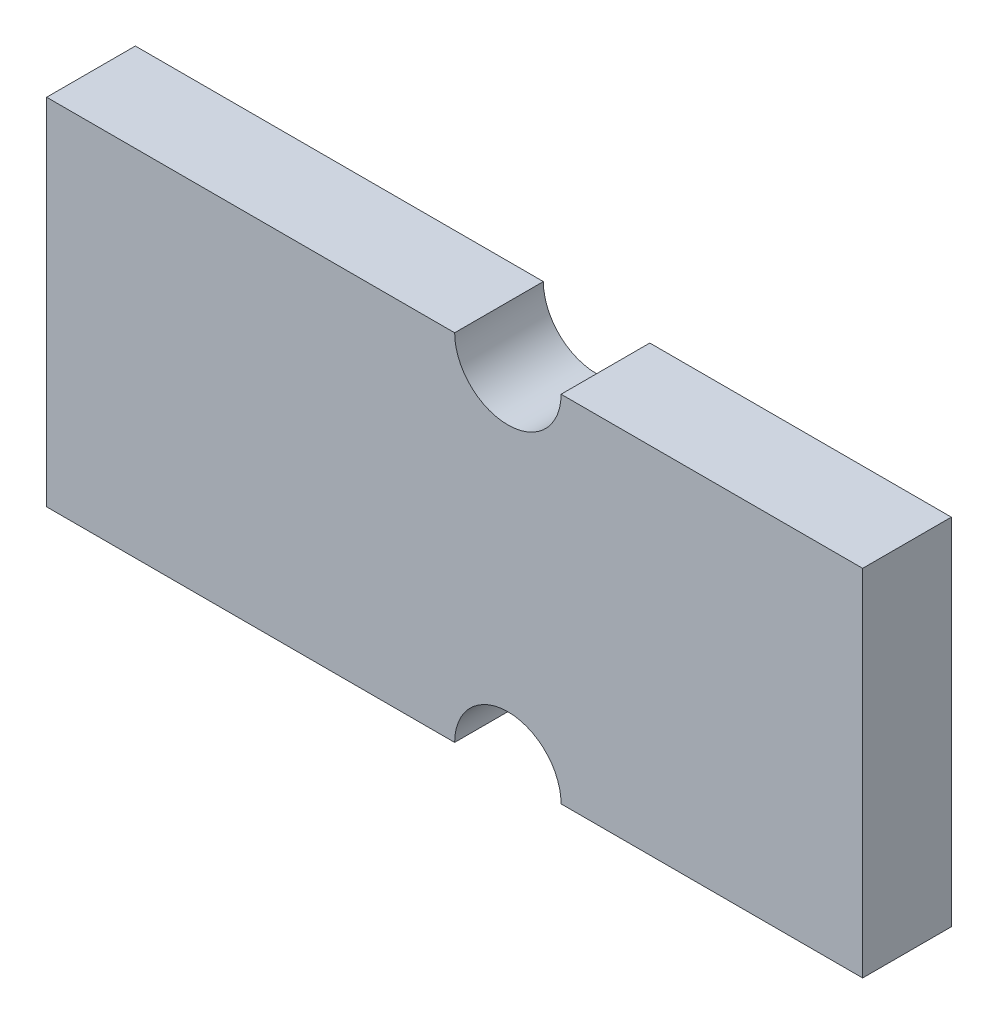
ISO-10303-21;
HEADER;
FILE_DESCRIPTION(('STEP AP214'),'2;1');
FILE_NAME('part.step','',(''),(''),'','','');
FILE_SCHEMA(('AUTOMOTIVE_DESIGN { 1 0 10303 214 1 1 1 1 }'));
ENDSEC;
DATA;
#1=APPLICATION_CONTEXT('core data for automotive mechanical design processes');
#2=APPLICATION_PROTOCOL_DEFINITION('international standard','automotive_design',2000,#1);
#3=PRODUCT_CONTEXT('',#1,'mechanical');
#4=PRODUCT('Part','Part','',(#3));
#5=PRODUCT_RELATED_PRODUCT_CATEGORY('part','',(#4));
#6=PRODUCT_DEFINITION_FORMATION('','',#4);
#7=PRODUCT_DEFINITION_CONTEXT('part definition',#1,'design');
#8=PRODUCT_DEFINITION('design','',#6,#7);
#9=PRODUCT_DEFINITION_SHAPE('','',#8);
#10=(LENGTH_UNIT() NAMED_UNIT(*) SI_UNIT(.MILLI.,.METRE.));
#11=(NAMED_UNIT(*) PLANE_ANGLE_UNIT() SI_UNIT($,.RADIAN.));
#12=(NAMED_UNIT(*) SI_UNIT($,.STERADIAN.) SOLID_ANGLE_UNIT());
#13=UNCERTAINTY_MEASURE_WITH_UNIT(LENGTH_MEASURE(1.E-05),#10,'distance_accuracy_value','');
#14=(GEOMETRIC_REPRESENTATION_CONTEXT(3) GLOBAL_UNCERTAINTY_ASSIGNED_CONTEXT((#13)) GLOBAL_UNIT_ASSIGNED_CONTEXT((#10,
#11,#12)) REPRESENTATION_CONTEXT('',''));
#15=CARTESIAN_POINT('',(0.,0.,0.));
#16=DIRECTION('',(0.,0.,1.));
#17=DIRECTION('',(1.,0.,0.));
#18=AXIS2_PLACEMENT_3D('',#15,#16,#17);
#19=CARTESIAN_POINT('',(0.,-50.,12.5));
#20=DIRECTION('',(0.,1.,0.));
#21=DIRECTION('',(-1.,0.,0.));
#22=AXIS2_PLACEMENT_3D('',#19,#20,#21);
#23=PLANE('',#22);
#24=DIRECTION('',(1.,0.,0.));
#25=VECTOR('',#24,1.);
#26=CARTESIAN_POINT('',(0.,-50.,-12.5));
#27=LINE('',#26,#25);
#28=CARTESIAN_POINT('',(-115.,-50.,-12.5));
#29=VERTEX_POINT('',#28);
#30=CARTESIAN_POINT('',(0.,-50.,-12.5));
#31=VERTEX_POINT('',#30);
#32=EDGE_CURVE('E130',#29,#31,#27,.T.);
#33=ORIENTED_EDGE('',*,*,#32,.T.);
#34=DIRECTION('',(0.,0.,-1.));
#35=VECTOR('',#34,1.);
#36=CARTESIAN_POINT('',(0.,-50.,12.5));
#37=LINE('',#36,#35);
#38=CARTESIAN_POINT('',(0.,-50.,12.5));
#39=VERTEX_POINT('',#38);
#40=EDGE_CURVE('E11',#39,#31,#37,.T.);
#41=ORIENTED_EDGE('',*,*,#40,.F.);
#42=DIRECTION('',(1.,0.,0.));
#43=VECTOR('',#42,1.);
#44=CARTESIAN_POINT('',(0.,-50.,12.5));
#45=LINE('',#44,#43);
#46=CARTESIAN_POINT('',(-115.,-50.,12.5));
#47=VERTEX_POINT('',#46);
#48=EDGE_CURVE('E144',#47,#39,#45,.T.);
#49=ORIENTED_EDGE('',*,*,#48,.F.);
#50=DIRECTION('',(0.,0.,-1.));
#51=VECTOR('',#50,1.);
#52=CARTESIAN_POINT('',(-115.,-50.,12.5));
#53=LINE('',#52,#51);
#54=EDGE_CURVE('E126',#47,#29,#53,.T.);
#55=ORIENTED_EDGE('',*,*,#54,.T.);
#56=EDGE_LOOP('',(#33,#41,#49,#55));
#57=FACE_BOUND('',#56,.T.);
#58=ADVANCED_FACE('F34',(#57),#23,.F.);
#59=CARTESIAN_POINT('',(15.,-50.,12.5));
#60=DIRECTION('',(0.,0.,-1.));
#61=DIRECTION('',(-1.,0.,0.));
#62=AXIS2_PLACEMENT_3D('',#59,#60,#61);
#63=CYLINDRICAL_SURFACE('',#62,15.);
#64=CARTESIAN_POINT('',(15.,-50.,-12.5));
#65=DIRECTION('',(0.,0.,-1.));
#66=DIRECTION('',(1.,0.,0.));
#67=AXIS2_PLACEMENT_3D('',#64,#65,#66);
#68=CIRCLE('',#67,15.);
#69=CARTESIAN_POINT('',(30.,-50.,-12.5));
#70=VERTEX_POINT('',#69);
#71=EDGE_CURVE('E133',#31,#70,#68,.T.);
#72=ORIENTED_EDGE('',*,*,#71,.T.);
#73=DIRECTION('',(0.,0.,-1.));
#74=VECTOR('',#73,1.);
#75=CARTESIAN_POINT('',(30.,-50.,12.5));
#76=LINE('',#75,#74);
#77=CARTESIAN_POINT('',(30.,-50.,12.5));
#78=VERTEX_POINT('',#77);
#79=EDGE_CURVE('E42',#78,#70,#76,.T.);
#80=ORIENTED_EDGE('',*,*,#79,.F.);
#81=CARTESIAN_POINT('',(15.,-50.,12.5));
#82=DIRECTION('',(0.,0.,-1.));
#83=DIRECTION('',(1.,0.,0.));
#84=AXIS2_PLACEMENT_3D('',#81,#82,#83);
#85=CIRCLE('',#84,15.);
#86=EDGE_CURVE('E93',#39,#78,#85,.T.);
#87=ORIENTED_EDGE('',*,*,#86,.F.);
#88=ORIENTED_EDGE('',*,*,#40,.T.);
#89=EDGE_LOOP('',(#72,#80,#87,#88));
#90=FACE_BOUND('',#89,.T.);
#91=ADVANCED_FACE('F179',(#90),#63,.F.);
#92=CARTESIAN_POINT('',(115.,-50.,12.5));
#93=DIRECTION('',(0.,1.,0.));
#94=DIRECTION('',(-1.,0.,0.));
#95=AXIS2_PLACEMENT_3D('',#92,#93,#94);
#96=PLANE('',#95);
#97=DIRECTION('',(1.,0.,0.));
#98=VECTOR('',#97,1.);
#99=CARTESIAN_POINT('',(115.,-50.,-12.5));
#100=LINE('',#99,#98);
#101=CARTESIAN_POINT('',(115.,-50.,-12.5));
#102=VERTEX_POINT('',#101);
#103=EDGE_CURVE('E135',#70,#102,#100,.T.);
#104=ORIENTED_EDGE('',*,*,#103,.T.);
#105=DIRECTION('',(0.,0.,-1.));
#106=VECTOR('',#105,1.);
#107=CARTESIAN_POINT('',(115.,-50.,12.5));
#108=LINE('',#107,#106);
#109=CARTESIAN_POINT('',(115.,-50.,12.5));
#110=VERTEX_POINT('',#109);
#111=EDGE_CURVE('E151',#110,#102,#108,.T.);
#112=ORIENTED_EDGE('',*,*,#111,.F.);
#113=DIRECTION('',(1.,0.,0.));
#114=VECTOR('',#113,1.);
#115=CARTESIAN_POINT('',(115.,-50.,12.5));
#116=LINE('',#115,#114);
#117=EDGE_CURVE('E159',#78,#110,#116,.T.);
#118=ORIENTED_EDGE('',*,*,#117,.F.);
#119=ORIENTED_EDGE('',*,*,#79,.T.);
#120=EDGE_LOOP('',(#104,#112,#118,#119));
#121=FACE_BOUND('',#120,.T.);
#122=ADVANCED_FACE('F157',(#121),#96,.F.);
#123=CARTESIAN_POINT('',(115.,50.,12.5));
#124=DIRECTION('',(-1.,0.,0.));
#125=DIRECTION('',(0.,0.,1.));
#126=AXIS2_PLACEMENT_3D('',#123,#124,#125);
#127=PLANE('',#126);
#128=DIRECTION('',(0.,1.,0.));
#129=VECTOR('',#128,1.);
#130=CARTESIAN_POINT('',(115.,50.,-12.5));
#131=LINE('',#130,#129);
#132=CARTESIAN_POINT('',(115.,50.,-12.5));
#133=VERTEX_POINT('',#132);
#134=EDGE_CURVE('E137',#102,#133,#131,.T.);
#135=ORIENTED_EDGE('',*,*,#134,.T.);
#136=DIRECTION('',(0.,0.,-1.));
#137=VECTOR('',#136,1.);
#138=CARTESIAN_POINT('',(115.,50.,12.5));
#139=LINE('',#138,#137);
#140=CARTESIAN_POINT('',(115.,50.,12.5));
#141=VERTEX_POINT('',#140);
#142=EDGE_CURVE('E148',#141,#133,#139,.T.);
#143=ORIENTED_EDGE('',*,*,#142,.F.);
#144=DIRECTION('',(0.,1.,0.));
#145=VECTOR('',#144,1.);
#146=CARTESIAN_POINT('',(115.,50.,12.5));
#147=LINE('',#146,#145);
#148=EDGE_CURVE('E171',#110,#141,#147,.T.);
#149=ORIENTED_EDGE('',*,*,#148,.F.);
#150=ORIENTED_EDGE('',*,*,#111,.T.);
#151=EDGE_LOOP('',(#135,#143,#149,#150));
#152=FACE_BOUND('',#151,.T.);
#153=ADVANCED_FACE('F167',(#152),#127,.F.);
#154=CARTESIAN_POINT('',(115.,50.,12.5));
#155=DIRECTION('',(0.,-1.,0.));
#156=DIRECTION('',(1.,0.,0.));
#157=AXIS2_PLACEMENT_3D('',#154,#155,#156);
#158=PLANE('',#157);
#159=DIRECTION('',(-1.,0.,0.));
#160=VECTOR('',#159,1.);
#161=CARTESIAN_POINT('',(115.,50.,-12.5));
#162=LINE('',#161,#160);
#163=CARTESIAN_POINT('',(30.,50.,-12.5));
#164=VERTEX_POINT('',#163);
#165=EDGE_CURVE('E139',#133,#164,#162,.T.);
#166=ORIENTED_EDGE('',*,*,#165,.T.);
#167=DIRECTION('',(0.,0.,-1.));
#168=VECTOR('',#167,1.);
#169=CARTESIAN_POINT('',(30.,50.,12.5));
#170=LINE('',#169,#168);
#171=CARTESIAN_POINT('',(30.,50.,12.5));
#172=VERTEX_POINT('',#171);
#173=EDGE_CURVE('E121',#172,#164,#170,.T.);
#174=ORIENTED_EDGE('',*,*,#173,.F.);
#175=DIRECTION('',(-1.,0.,0.));
#176=VECTOR('',#175,1.);
#177=CARTESIAN_POINT('',(115.,50.,12.5));
#178=LINE('',#177,#176);
#179=EDGE_CURVE('E112',#141,#172,#178,.T.);
#180=ORIENTED_EDGE('',*,*,#179,.F.);
#181=ORIENTED_EDGE('',*,*,#142,.T.);
#182=EDGE_LOOP('',(#166,#174,#180,#181));
#183=FACE_BOUND('',#182,.T.);
#184=ADVANCED_FACE('F170',(#183),#158,.F.);
#185=CARTESIAN_POINT('',(15.,50.,12.5));
#186=DIRECTION('',(0.,0.,-1.));
#187=DIRECTION('',(-1.,0.,0.));
#188=AXIS2_PLACEMENT_3D('',#185,#186,#187);
#189=CYLINDRICAL_SURFACE('',#188,15.);
#190=CARTESIAN_POINT('',(15.,50.,-12.5));
#191=DIRECTION('',(0.,0.,-1.));
#192=DIRECTION('',(-1.,0.,0.));
#193=AXIS2_PLACEMENT_3D('',#190,#191,#192);
#194=CIRCLE('',#193,15.);
#195=CARTESIAN_POINT('',(0.,50.,-12.5));
#196=VERTEX_POINT('',#195);
#197=EDGE_CURVE('E120',#164,#196,#194,.T.);
#198=ORIENTED_EDGE('',*,*,#197,.T.);
#199=DIRECTION('',(0.,0.,-1.));
#200=VECTOR('',#199,1.);
#201=CARTESIAN_POINT('',(0.,50.,12.5));
#202=LINE('',#201,#200);
#203=CARTESIAN_POINT('',(0.,50.,12.5));
#204=VERTEX_POINT('',#203);
#205=EDGE_CURVE('E117',#204,#196,#202,.T.);
#206=ORIENTED_EDGE('',*,*,#205,.F.);
#207=CARTESIAN_POINT('',(15.,50.,12.5));
#208=DIRECTION('',(0.,0.,-1.));
#209=DIRECTION('',(-1.,0.,0.));
#210=AXIS2_PLACEMENT_3D('',#207,#208,#209);
#211=CIRCLE('',#210,15.);
#212=EDGE_CURVE('E106',#172,#204,#211,.T.);
#213=ORIENTED_EDGE('',*,*,#212,.F.);
#214=ORIENTED_EDGE('',*,*,#173,.T.);
#215=EDGE_LOOP('',(#198,#206,#213,#214));
#216=FACE_BOUND('',#215,.T.);
#217=ADVANCED_FACE('F118',(#216),#189,.F.);
#218=CARTESIAN_POINT('',(0.,50.,12.5));
#219=DIRECTION('',(0.,-1.,0.));
#220=DIRECTION('',(1.,0.,0.));
#221=AXIS2_PLACEMENT_3D('',#218,#219,#220);
#222=PLANE('',#221);
#223=DIRECTION('',(-1.,0.,0.));
#224=VECTOR('',#223,1.);
#225=CARTESIAN_POINT('',(0.,50.,-12.5));
#226=LINE('',#225,#224);
#227=CARTESIAN_POINT('',(-115.,50.,-12.5));
#228=VERTEX_POINT('',#227);
#229=EDGE_CURVE('E79',#196,#228,#226,.T.);
#230=ORIENTED_EDGE('',*,*,#229,.T.);
#231=DIRECTION('',(0.,0.,-1.));
#232=VECTOR('',#231,1.);
#233=CARTESIAN_POINT('',(-115.,50.,12.5));
#234=LINE('',#233,#232);
#235=CARTESIAN_POINT('',(-115.,50.,12.5));
#236=VERTEX_POINT('',#235);
#237=EDGE_CURVE('E122',#236,#228,#234,.T.);
#238=ORIENTED_EDGE('',*,*,#237,.F.);
#239=DIRECTION('',(-1.,0.,0.));
#240=VECTOR('',#239,1.);
#241=CARTESIAN_POINT('',(0.,50.,12.5));
#242=LINE('',#241,#240);
#243=EDGE_CURVE('E110',#204,#236,#242,.T.);
#244=ORIENTED_EDGE('',*,*,#243,.F.);
#245=ORIENTED_EDGE('',*,*,#205,.T.);
#246=EDGE_LOOP('',(#230,#238,#244,#245));
#247=FACE_BOUND('',#246,.T.);
#248=ADVANCED_FACE('F124',(#247),#222,.F.);
#249=CARTESIAN_POINT('',(-115.,50.,12.5));
#250=DIRECTION('',(1.,0.,0.));
#251=DIRECTION('',(0.,1.,0.));
#252=AXIS2_PLACEMENT_3D('',#249,#250,#251);
#253=PLANE('',#252);
#254=DIRECTION('',(0.,-1.,0.));
#255=VECTOR('',#254,1.);
#256=CARTESIAN_POINT('',(-115.,50.,-12.5));
#257=LINE('',#256,#255);
#258=EDGE_CURVE('E85',#228,#29,#257,.T.);
#259=ORIENTED_EDGE('',*,*,#258,.T.);
#260=ORIENTED_EDGE('',*,*,#54,.F.);
#261=DIRECTION('',(0.,-1.,0.));
#262=VECTOR('',#261,1.);
#263=CARTESIAN_POINT('',(-115.,50.,12.5));
#264=LINE('',#263,#262);
#265=EDGE_CURVE('E50',#236,#47,#264,.T.);
#266=ORIENTED_EDGE('',*,*,#265,.F.);
#267=ORIENTED_EDGE('',*,*,#237,.T.);
#268=EDGE_LOOP('',(#259,#260,#266,#267));
#269=FACE_BOUND('',#268,.T.);
#270=ADVANCED_FACE('F195',(#269),#253,.F.);
#271=CARTESIAN_POINT('',(15.,50.,12.5));
#272=DIRECTION('',(0.,0.,-1.));
#273=DIRECTION('',(-1.,0.,0.));
#274=AXIS2_PLACEMENT_3D('',#271,#272,#273);
#275=PLANE('',#274);
#276=ORIENTED_EDGE('',*,*,#48,.T.);
#277=ORIENTED_EDGE('',*,*,#86,.T.);
#278=ORIENTED_EDGE('',*,*,#117,.T.);
#279=ORIENTED_EDGE('',*,*,#148,.T.);
#280=ORIENTED_EDGE('',*,*,#179,.T.);
#281=ORIENTED_EDGE('',*,*,#212,.T.);
#282=ORIENTED_EDGE('',*,*,#243,.T.);
#283=ORIENTED_EDGE('',*,*,#265,.T.);
#284=EDGE_LOOP('',(#276,#277,#278,#279,#280,#281,#282,#283));
#285=FACE_BOUND('',#284,.T.);
#286=ADVANCED_FACE('F108',(#285),#275,.F.);
#287=CARTESIAN_POINT('',(15.,50.,-12.5));
#288=DIRECTION('',(0.,0.,-1.));
#289=DIRECTION('',(-1.,0.,0.));
#290=AXIS2_PLACEMENT_3D('',#287,#288,#289);
#291=PLANE('',#290);
#292=ORIENTED_EDGE('',*,*,#32,.F.);
#293=ORIENTED_EDGE('',*,*,#258,.F.);
#294=ORIENTED_EDGE('',*,*,#229,.F.);
#295=ORIENTED_EDGE('',*,*,#197,.F.);
#296=ORIENTED_EDGE('',*,*,#165,.F.);
#297=ORIENTED_EDGE('',*,*,#134,.F.);
#298=ORIENTED_EDGE('',*,*,#103,.F.);
#299=ORIENTED_EDGE('',*,*,#71,.F.);
#300=EDGE_LOOP('',(#292,#293,#294,#295,#296,#297,#298,#299));
#301=FACE_BOUND('',#300,.T.);
#302=ADVANCED_FACE('F163',(#301),#291,.T.);
#303=CLOSED_SHELL('',(#58,#91,#122,#153,#184,#217,#248,#270,#286,#302));
#304=MANIFOLD_SOLID_BREP('B2',#303);
#305=ADVANCED_BREP_SHAPE_REPRESENTATION('',(#18,#304),#14);
#306=SHAPE_DEFINITION_REPRESENTATION(#9,#305);
ENDSEC;
END-ISO-10303-21;
